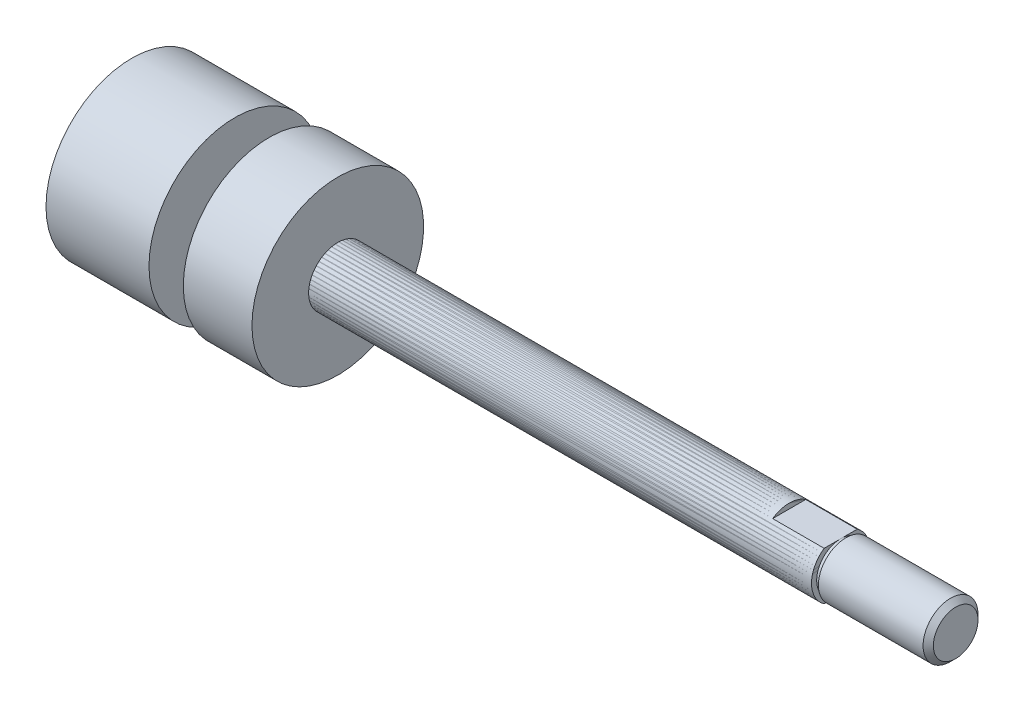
ISO-10303-21;
HEADER;
FILE_DESCRIPTION(('STEP AP214'),'2;1');
FILE_NAME('part.step','',(''),(''),'','','');
FILE_SCHEMA(('AUTOMOTIVE_DESIGN { 1 0 10303 214 1 1 1 1 }'));
ENDSEC;
DATA;
#1=APPLICATION_CONTEXT('core data for automotive mechanical design processes');
#2=APPLICATION_PROTOCOL_DEFINITION('international standard','automotive_design',2000,#1);
#3=PRODUCT_CONTEXT('',#1,'mechanical');
#4=PRODUCT('Part','Part','',(#3));
#5=PRODUCT_RELATED_PRODUCT_CATEGORY('part','',(#4));
#6=PRODUCT_DEFINITION_FORMATION('','',#4);
#7=PRODUCT_DEFINITION_CONTEXT('part definition',#1,'design');
#8=PRODUCT_DEFINITION('design','',#6,#7);
#9=PRODUCT_DEFINITION_SHAPE('','',#8);
#10=(LENGTH_UNIT() NAMED_UNIT(*) SI_UNIT(.MILLI.,.METRE.));
#11=(NAMED_UNIT(*) PLANE_ANGLE_UNIT() SI_UNIT($,.RADIAN.));
#12=(NAMED_UNIT(*) SI_UNIT($,.STERADIAN.) SOLID_ANGLE_UNIT());
#13=UNCERTAINTY_MEASURE_WITH_UNIT(LENGTH_MEASURE(1.E-05),#10,'distance_accuracy_value','');
#14=(GEOMETRIC_REPRESENTATION_CONTEXT(3) GLOBAL_UNCERTAINTY_ASSIGNED_CONTEXT((#13)) GLOBAL_UNIT_ASSIGNED_CONTEXT((#10,
#11,#12)) REPRESENTATION_CONTEXT('',''));
#15=CARTESIAN_POINT('',(0.,0.,0.));
#16=DIRECTION('',(0.,0.,1.));
#17=DIRECTION('',(1.,0.,0.));
#18=AXIS2_PLACEMENT_3D('',#15,#16,#17);
#19=CARTESIAN_POINT('',(119.21874581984,-1.4380063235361,-9.0792146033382));
#20=DIRECTION('',(1.,0.,0.));
#21=DIRECTION('',(0.,0.809016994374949,0.587785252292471));
#22=AXIS2_PLACEMENT_3D('',#19,#20,#21);
#23=PLANE('',#22);
#24=CARTESIAN_POINT('',(119.21874581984,0.,0.));
#25=DIRECTION('',(-1.,0.,0.));
#26=DIRECTION('',(0.,0.,1.));
#27=AXIS2_PLACEMENT_3D('',#24,#25,#26);
#28=CIRCLE('',#27,6.50000000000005);
#29=CARTESIAN_POINT('',(119.21874581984,0.,6.50000000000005));
#30=VERTEX_POINT('',#29);
#31=EDGE_CURVE('P0_E352',#30,#30,#28,.F.);
#32=ORIENTED_EDGE('',*,*,#31,.T.);
#33=EDGE_LOOP('',(#32));
#34=FACE_BOUND('',#33,.T.);
#35=ADVANCED_FACE('P0_F348',(#34),#23,.T.);
#36=CARTESIAN_POINT('',(119.21874581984,0.,0.));
#37=DIRECTION('',(-1.,0.,0.));
#38=DIRECTION('',(0.,0.,1.));
#39=AXIS2_PLACEMENT_3D('',#36,#37,#38);
#40=CONICAL_SURFACE('',#39,6.50000000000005,0.785398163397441);
#41=ORIENTED_EDGE('',*,*,#31,.F.);
#42=EDGE_LOOP('',(#41));
#43=FACE_BOUND('',#42,.T.);
#44=CARTESIAN_POINT('',(117.71874581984,0.,0.));
#45=DIRECTION('',(-1.,0.,0.));
#46=DIRECTION('',(0.,0.809016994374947,0.587785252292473));
#47=AXIS2_PLACEMENT_3D('',#44,#45,#46);
#48=CIRCLE('',#47,8.00000000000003);
#49=CARTESIAN_POINT('',(117.71874581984,6.4721359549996,4.7022820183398));
#50=VERTEX_POINT('',#49);
#51=EDGE_CURVE('P0_E443',#50,#50,#48,.F.);
#52=ORIENTED_EDGE('',*,*,#51,.T.);
#53=EDGE_LOOP('',(#52));
#54=FACE_BOUND('',#53,.T.);
#55=ADVANCED_FACE('P0_F493',(#43,#54),#40,.T.);
#56=CARTESIAN_POINT('',(117.71874581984,0.,0.));
#57=DIRECTION('',(-1.,0.,0.));
#58=DIRECTION('',(0.,0.,1.));
#59=AXIS2_PLACEMENT_3D('',#56,#57,#58);
#60=CYLINDRICAL_SURFACE('',#59,8.00000000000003);
#61=ORIENTED_EDGE('',*,*,#51,.F.);
#62=EDGE_LOOP('',(#61));
#63=FACE_BOUND('',#62,.T.);
#64=CARTESIAN_POINT('',(87.218745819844,0.,0.));
#65=DIRECTION('',(-1.,0.,0.));
#66=DIRECTION('',(0.,0.,1.));
#67=AXIS2_PLACEMENT_3D('',#64,#65,#66);
#68=CIRCLE('',#67,8.00000000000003);
#69=CARTESIAN_POINT('',(87.218745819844,0.,8.00000000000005));
#70=VERTEX_POINT('',#69);
#71=EDGE_CURVE('P0_E441',#70,#70,#68,.T.);
#72=ORIENTED_EDGE('',*,*,#71,.F.);
#73=EDGE_LOOP('',(#72));
#74=FACE_BOUND('',#73,.T.);
#75=ADVANCED_FACE('P0_F497',(#63,#74),#60,.T.);
#76=CARTESIAN_POINT('',(87.218745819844,-11.174417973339,1.7698539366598));
#77=DIRECTION('',(-1.,0.,0.));
#78=DIRECTION('',(0.,0.809016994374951,0.587785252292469));
#79=AXIS2_PLACEMENT_3D('',#76,#77,#78);
#80=PLANE('',#79);
#81=CARTESIAN_POINT('',(87.218745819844,0.,0.));
#82=DIRECTION('',(-1.,0.,0.));
#83=DIRECTION('',(0.,0.,1.));
#84=AXIS2_PLACEMENT_3D('',#81,#82,#83);
#85=CIRCLE('',#84,7.00000000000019);
#86=CARTESIAN_POINT('',(87.218745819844,0.,7.00000000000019));
#87=VERTEX_POINT('',#86);
#88=EDGE_CURVE('P0_E405',#87,#87,#85,.F.);
#89=ORIENTED_EDGE('',*,*,#88,.T.);
#90=EDGE_LOOP('',(#89));
#91=FACE_BOUND('',#90,.T.);
#92=ORIENTED_EDGE('',*,*,#71,.T.);
#93=EDGE_LOOP('',(#92));
#94=FACE_BOUND('',#93,.T.);
#95=ADVANCED_FACE('P0_F495',(#91,#94),#80,.T.);
#96=CARTESIAN_POINT('',(87.218745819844,0.,0.));
#97=DIRECTION('',(-1.,0.,0.));
#98=DIRECTION('',(0.,0.,1.));
#99=AXIS2_PLACEMENT_3D('',#96,#97,#98);
#100=CYLINDRICAL_SURFACE('',#99,7.00000000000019);
#101=ORIENTED_EDGE('',*,*,#88,.F.);
#102=EDGE_LOOP('',(#101));
#103=FACE_BOUND('',#102,.T.);
#104=CARTESIAN_POINT('',(85.718745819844,0.,0.));
#105=DIRECTION('',(-1.,0.,0.));
#106=DIRECTION('',(0.,0.,1.));
#107=AXIS2_PLACEMENT_3D('',#104,#105,#106);
#108=CIRCLE('',#107,7.00000000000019);
#109=CARTESIAN_POINT('',(85.718745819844,7.00000000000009,0.));
#110=VERTEX_POINT('',#109);
#111=CARTESIAN_POINT('',(85.718745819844,-7.00000000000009,1.33543146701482E-13));
#112=VERTEX_POINT('',#111);
#113=EDGE_CURVE('P0_E408',#110,#112,#108,.T.);
#114=ORIENTED_EDGE('',*,*,#113,.F.);
#115=CARTESIAN_POINT('',(85.718745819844,0.,0.));
#116=DIRECTION('',(-1.,0.,0.));
#117=DIRECTION('',(0.,0.,1.));
#118=AXIS2_PLACEMENT_3D('',#115,#116,#117);
#119=CIRCLE('',#118,7.00000000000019);
#120=EDGE_CURVE('P0_E396',#110,#112,#119,.F.);
#121=ORIENTED_EDGE('',*,*,#120,.T.);
#122=EDGE_LOOP('',(#114,#121));
#123=FACE_BOUND('',#122,.T.);
#124=ADVANCED_FACE('P0_F410',(#103,#123),#100,.T.);
#125=CARTESIAN_POINT('',(85.718745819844,-1.880469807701,-11.872819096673));
#126=DIRECTION('',(1.,0.,0.));
#127=DIRECTION('',(0.,0.809016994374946,0.587785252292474));
#128=AXIS2_PLACEMENT_3D('',#125,#126,#127);
#129=PLANE('',#128);
#130=ORIENTED_EDGE('',*,*,#120,.F.);
#131=DIRECTION('',(0.,0.,1.));
#132=VECTOR('',#131,1.);
#133=CARTESIAN_POINT('',(85.718745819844,7.,-2.67817461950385));
#134=LINE('',#133,#132);
#135=CARTESIAN_POINT('',(85.718745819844,7.00000000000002,4.82182538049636));
#136=VERTEX_POINT('',#135);
#137=EDGE_CURVE('P0_E400',#110,#136,#134,.T.);
#138=ORIENTED_EDGE('',*,*,#137,.T.);
#139=CARTESIAN_POINT('',(85.718745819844,0.,0.));
#140=DIRECTION('',(-1.,0.,0.));
#141=DIRECTION('',(0.,0.,1.));
#142=AXIS2_PLACEMENT_3D('',#139,#140,#141);
#143=CIRCLE('',#142,8.49999999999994);
#144=CARTESIAN_POINT('',(85.718745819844,-7.00000000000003,4.82182538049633));
#145=VERTEX_POINT('',#144);
#146=EDGE_CURVE('P0_E365',#136,#145,#143,.F.);
#147=ORIENTED_EDGE('',*,*,#146,.T.);
#148=DIRECTION('',(0.,0.,-1.));
#149=VECTOR('',#148,1.);
#150=CARTESIAN_POINT('',(85.718745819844,-7.,-2.67817461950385));
#151=LINE('',#150,#149);
#152=EDGE_CURVE('P0_E402',#145,#112,#151,.T.);
#153=ORIENTED_EDGE('',*,*,#152,.T.);
#154=EDGE_LOOP('',(#130,#138,#147,#153));
#155=FACE_BOUND('',#154,.T.);
#156=ADVANCED_FACE('P0_F398',(#155),#129,.T.);
#157=CARTESIAN_POINT('',(70.718745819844,-7.,4.8218253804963));
#158=DIRECTION('',(-1.,0.,0.));
#159=DIRECTION('',(0.,0.,-1.));
#160=AXIS2_PLACEMENT_3D('',#157,#158,#159);
#161=PLANE('',#160);
#162=CARTESIAN_POINT('',(70.7187458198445,0.,0.));
#163=DIRECTION('',(-1.,0.,0.));
#164=DIRECTION('',(0.,0.,1.));
#165=AXIS2_PLACEMENT_3D('',#162,#163,#164);
#166=CIRCLE('',#165,8.49999999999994);
#167=CARTESIAN_POINT('',(70.7187458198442,-7.00000000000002,4.82182538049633));
#168=VERTEX_POINT('',#167);
#169=CARTESIAN_POINT('',(70.7187458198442,-7.,-4.82182538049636));
#170=VERTEX_POINT('',#169);
#171=EDGE_CURVE('P0_E435',#168,#170,#166,.F.);
#172=ORIENTED_EDGE('',*,*,#171,.T.);
#173=DIRECTION('',(0.,0.,1.));
#174=VECTOR('',#173,1.);
#175=CARTESIAN_POINT('',(70.718745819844,-7.,-2.67817461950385));
#176=LINE('',#175,#174);
#177=EDGE_CURVE('P0_E414',#170,#168,#176,.T.);
#178=ORIENTED_EDGE('',*,*,#177,.T.);
#179=EDGE_LOOP('',(#172,#178));
#180=FACE_BOUND('',#179,.T.);
#181=ADVANCED_FACE('P0_F466',(#180),#161,.F.);
#182=CARTESIAN_POINT('',(85.718745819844,-7.,4.8218253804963));
#183=DIRECTION('',(0.,1.,0.));
#184=DIRECTION('',(0.,0.,-1.));
#185=AXIS2_PLACEMENT_3D('',#182,#183,#184);
#186=PLANE('',#185);
#187=DIRECTION('',(1.,0.,0.));
#188=VECTOR('',#187,1.);
#189=CARTESIAN_POINT('',(12.468745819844,-6.99999999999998,-4.82182538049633));
#190=LINE('',#189,#188);
#191=CARTESIAN_POINT('',(85.718745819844,-7.00000000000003,-4.82182538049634));
#192=VERTEX_POINT('',#191);
#193=EDGE_CURVE('P0_E434',#170,#192,#190,.T.);
#194=ORIENTED_EDGE('',*,*,#193,.T.);
#195=DIRECTION('',(0.,0.,-1.));
#196=VECTOR('',#195,1.);
#197=CARTESIAN_POINT('',(85.718745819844,-7.00000000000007,0.));
#198=LINE('',#197,#196);
#199=EDGE_CURVE('P0_E413',#112,#192,#198,.T.);
#200=ORIENTED_EDGE('',*,*,#199,.F.);
#201=ORIENTED_EDGE('',*,*,#152,.F.);
#202=DIRECTION('',(-1.,0.,0.));
#203=VECTOR('',#202,1.);
#204=CARTESIAN_POINT('',(12.468745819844,-7.00000000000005,4.82182538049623));
#205=LINE('',#204,#203);
#206=EDGE_CURVE('P0_E437',#145,#168,#205,.T.);
#207=ORIENTED_EDGE('',*,*,#206,.T.);
#208=ORIENTED_EDGE('',*,*,#177,.F.);
#209=EDGE_LOOP('',(#194,#200,#201,#207,#208));
#210=FACE_BOUND('',#209,.T.);
#211=ADVANCED_FACE('P0_F461',(#210),#186,.F.);
#212=CARTESIAN_POINT('',(85.718745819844,-0.784964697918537,-15.5542622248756));
#213=DIRECTION('',(1.,0.,0.));
#214=DIRECTION('',(0.,0.809016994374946,0.587785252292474));
#215=AXIS2_PLACEMENT_3D('',#212,#213,#214);
#216=PLANE('',#215);
#217=CARTESIAN_POINT('',(85.718745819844,0.,0.));
#218=DIRECTION('',(-1.,0.,0.));
#219=DIRECTION('',(0.,0.,1.));
#220=AXIS2_PLACEMENT_3D('',#217,#218,#219);
#221=CIRCLE('',#220,8.49999999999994);
#222=CARTESIAN_POINT('',(85.718745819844,7.00000000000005,-4.82182538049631));
#223=VERTEX_POINT('',#222);
#224=EDGE_CURVE('P0_E420',#192,#223,#221,.F.);
#225=ORIENTED_EDGE('',*,*,#224,.T.);
#226=DIRECTION('',(0.,0.,1.));
#227=VECTOR('',#226,1.);
#228=CARTESIAN_POINT('',(85.718745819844,7.,-2.67817461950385));
#229=LINE('',#228,#227);
#230=EDGE_CURVE('P0_E417',#223,#110,#229,.T.);
#231=ORIENTED_EDGE('',*,*,#230,.T.);
#232=ORIENTED_EDGE('',*,*,#113,.T.);
#233=ORIENTED_EDGE('',*,*,#199,.T.);
#234=EDGE_LOOP('',(#225,#231,#232,#233));
#235=FACE_BOUND('',#234,.T.);
#236=ADVANCED_FACE('P0_F418',(#235),#216,.T.);
#237=CARTESIAN_POINT('',(70.718745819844,10.3214285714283,4.8218253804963));
#238=DIRECTION('',(-1.,0.,0.));
#239=DIRECTION('',(0.,0.,-1.));
#240=AXIS2_PLACEMENT_3D('',#237,#238,#239);
#241=PLANE('',#240);
#242=CARTESIAN_POINT('',(70.7187458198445,0.,0.));
#243=DIRECTION('',(-1.,0.,0.));
#244=DIRECTION('',(0.,0.,1.));
#245=AXIS2_PLACEMENT_3D('',#242,#243,#244);
#246=CIRCLE('',#245,8.49999999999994);
#247=CARTESIAN_POINT('',(70.7187458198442,7.00000000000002,-4.8218253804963));
#248=VERTEX_POINT('',#247);
#249=CARTESIAN_POINT('',(70.7187458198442,7.,4.82182538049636));
#250=VERTEX_POINT('',#249);
#251=EDGE_CURVE('P0_E357',#248,#250,#246,.F.);
#252=ORIENTED_EDGE('',*,*,#251,.T.);
#253=DIRECTION('',(0.,0.,-1.));
#254=VECTOR('',#253,1.);
#255=CARTESIAN_POINT('',(70.718745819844,7.,-2.67817461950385));
#256=LINE('',#255,#254);
#257=EDGE_CURVE('P0_E425',#250,#248,#256,.T.);
#258=ORIENTED_EDGE('',*,*,#257,.T.);
#259=EDGE_LOOP('',(#252,#258));
#260=FACE_BOUND('',#259,.T.);
#261=ADVANCED_FACE('P0_F487',(#260),#241,.F.);
#262=CARTESIAN_POINT('',(70.718745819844,7.,4.8218253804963));
#263=DIRECTION('',(0.,-1.,0.));
#264=DIRECTION('',(0.,0.,-1.));
#265=AXIS2_PLACEMENT_3D('',#262,#263,#264);
#266=PLANE('',#265);
#267=DIRECTION('',(1.,0.,0.));
#268=VECTOR('',#267,1.);
#269=CARTESIAN_POINT('',(12.468745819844,6.99999999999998,4.82182538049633));
#270=LINE('',#269,#268);
#271=EDGE_CURVE('P0_E11',#250,#136,#270,.T.);
#272=ORIENTED_EDGE('',*,*,#271,.T.);
#273=ORIENTED_EDGE('',*,*,#137,.F.);
#274=ORIENTED_EDGE('',*,*,#230,.F.);
#275=DIRECTION('',(-1.,0.,0.));
#276=VECTOR('',#275,1.);
#277=CARTESIAN_POINT('',(12.468745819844,7.00000000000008,-4.82182538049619));
#278=LINE('',#277,#276);
#279=EDGE_CURVE('P0_E432',#223,#248,#278,.T.);
#280=ORIENTED_EDGE('',*,*,#279,.T.);
#281=ORIENTED_EDGE('',*,*,#257,.F.);
#282=EDGE_LOOP('',(#272,#273,#274,#280,#281));
#283=FACE_BOUND('',#282,.T.);
#284=ADVANCED_FACE('P0_F350',(#283),#266,.F.);
#285=CARTESIAN_POINT('',(85.718745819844,0.,0.));
#286=DIRECTION('',(-1.,0.,0.));
#287=DIRECTION('',(0.,0.,1.));
#288=AXIS2_PLACEMENT_3D('',#285,#286,#287);
#289=CYLINDRICAL_SURFACE('',#288,8.49999999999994);
#290=ORIENTED_EDGE('',*,*,#146,.F.);
#291=ORIENTED_EDGE('',*,*,#271,.F.);
#292=ORIENTED_EDGE('',*,*,#251,.F.);
#293=ORIENTED_EDGE('',*,*,#279,.F.);
#294=ORIENTED_EDGE('',*,*,#224,.F.);
#295=ORIENTED_EDGE('',*,*,#193,.F.);
#296=ORIENTED_EDGE('',*,*,#171,.F.);
#297=ORIENTED_EDGE('',*,*,#206,.F.);
#298=EDGE_LOOP('',(#290,#291,#292,#293,#294,#295,#296,#297));
#299=FACE_BOUND('',#298,.T.);
#300=CARTESIAN_POINT('',(-90.781254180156,0.,0.));
#301=DIRECTION('',(-1.,0.,0.));
#302=DIRECTION('',(0.,0.,1.));
#303=AXIS2_PLACEMENT_3D('',#300,#301,#302);
#304=CIRCLE('',#303,8.49999999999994);
#305=CARTESIAN_POINT('',(-90.781254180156,0.,8.49999999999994));
#306=VERTEX_POINT('',#305);
#307=EDGE_CURVE('P0_E451',#306,#306,#304,.T.);
#308=ORIENTED_EDGE('',*,*,#307,.F.);
#309=EDGE_LOOP('',(#308));
#310=FACE_BOUND('',#309,.T.);
#311=ADVANCED_FACE('P0_F463',(#299,#310),#289,.T.);
#312=CARTESIAN_POINT('',(-90.781254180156,0.,0.));
#313=DIRECTION('',(-1.,0.,0.));
#314=DIRECTION('',(0.,0.,1.));
#315=AXIS2_PLACEMENT_3D('',#312,#313,#314);
#316=PLANE('',#315);
#317=CARTESIAN_POINT('',(-90.781254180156,0.,0.));
#318=DIRECTION('',(-1.,0.,0.));
#319=DIRECTION('',(0.,0.,1.));
#320=AXIS2_PLACEMENT_3D('',#317,#318,#319);
#321=CIRCLE('',#320,25.);
#322=CARTESIAN_POINT('',(-90.781254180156,0.,25.));
#323=VERTEX_POINT('',#322);
#324=EDGE_CURVE('P0_E527',#323,#323,#321,.T.);
#325=ORIENTED_EDGE('',*,*,#324,.F.);
#326=EDGE_LOOP('',(#325));
#327=FACE_BOUND('',#326,.T.);
#328=ORIENTED_EDGE('',*,*,#307,.T.);
#329=EDGE_LOOP('',(#328));
#330=FACE_BOUND('',#329,.T.);
#331=ADVANCED_FACE('P0_F477',(#327,#330),#316,.F.);
#332=CARTESIAN_POINT('',(-120.781254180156,0.,0.));
#333=DIRECTION('',(1.,0.,0.));
#334=DIRECTION('',(0.,0.,-1.));
#335=AXIS2_PLACEMENT_3D('',#332,#333,#334);
#336=CYLINDRICAL_SURFACE('',#335,25.);
#337=CARTESIAN_POINT('',(-120.781254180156,0.,0.));
#338=DIRECTION('',(-1.,0.,0.));
#339=DIRECTION('',(0.,0.,1.));
#340=AXIS2_PLACEMENT_3D('',#337,#338,#339);
#341=CIRCLE('',#340,25.);
#342=CARTESIAN_POINT('',(-120.781254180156,0.,25.));
#343=VERTEX_POINT('',#342);
#344=EDGE_CURVE('P0_E525',#343,#343,#341,.T.);
#345=ORIENTED_EDGE('',*,*,#344,.F.);
#346=EDGE_LOOP('',(#345));
#347=FACE_BOUND('',#346,.T.);
#348=ORIENTED_EDGE('',*,*,#324,.T.);
#349=EDGE_LOOP('',(#348));
#350=FACE_BOUND('',#349,.T.);
#351=ADVANCED_FACE('P0_F483',(#347,#350),#336,.T.);
#352=CARTESIAN_POINT('',(-120.781254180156,0.,0.));
#353=DIRECTION('',(-1.,0.,0.));
#354=DIRECTION('',(0.,0.,1.));
#355=AXIS2_PLACEMENT_3D('',#352,#353,#354);
#356=PLANE('',#355);
#357=ORIENTED_EDGE('',*,*,#344,.T.);
#358=EDGE_LOOP('',(#357));
#359=FACE_BOUND('',#358,.T.);
#360=ADVANCED_FACE('P0_F517',(#359),#356,.T.);
#361=CLOSED_SHELL('',(#35,#55,#75,#95,#124,#156,#181,#211,#236,#261,#284,#311,#331,#351,#360));
#362=MANIFOLD_SOLID_BREP('P0_B2',#361);
#363=CARTESIAN_POINT('',(119.21874581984,-1.4380063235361,-9.0792146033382));
#364=DIRECTION('',(1.,0.,0.));
#365=DIRECTION('',(0.,0.809016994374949,0.587785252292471));
#366=AXIS2_PLACEMENT_3D('',#363,#364,#365);
#367=PLANE('',#366);
#368=CARTESIAN_POINT('',(119.21874581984,0.,0.));
#369=DIRECTION('',(-1.,0.,0.));
#370=DIRECTION('',(0.,0.,1.));
#371=AXIS2_PLACEMENT_3D('',#368,#369,#370);
#372=CIRCLE('',#371,6.50000000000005);
#373=CARTESIAN_POINT('',(119.21874581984,0.,6.50000000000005));
#374=VERTEX_POINT('',#373);
#375=EDGE_CURVE('P1_E19',#374,#374,#372,.F.);
#376=ORIENTED_EDGE('',*,*,#375,.T.);
#377=EDGE_LOOP('',(#376));
#378=FACE_BOUND('',#377,.T.);
#379=ADVANCED_FACE('P1_F15',(#378),#367,.T.);
#380=CARTESIAN_POINT('',(119.21874581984,0.,0.));
#381=DIRECTION('',(-1.,0.,0.));
#382=DIRECTION('',(0.,0.,1.));
#383=AXIS2_PLACEMENT_3D('',#380,#381,#382);
#384=CONICAL_SURFACE('',#383,6.50000000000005,0.785398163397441);
#385=ORIENTED_EDGE('',*,*,#375,.F.);
#386=EDGE_LOOP('',(#385));
#387=FACE_BOUND('',#386,.T.);
#388=CARTESIAN_POINT('',(117.71874581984,0.,0.));
#389=DIRECTION('',(-1.,0.,0.));
#390=DIRECTION('',(0.,0.809016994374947,0.587785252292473));
#391=AXIS2_PLACEMENT_3D('',#388,#389,#390);
#392=CIRCLE('',#391,8.00000000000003);
#393=CARTESIAN_POINT('',(117.71874581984,6.4721359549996,4.7022820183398));
#394=VERTEX_POINT('',#393);
#395=EDGE_CURVE('P1_E119',#394,#394,#392,.F.);
#396=ORIENTED_EDGE('',*,*,#395,.T.);
#397=EDGE_LOOP('',(#396));
#398=FACE_BOUND('',#397,.T.);
#399=ADVANCED_FACE('P1_F168',(#387,#398),#384,.T.);
#400=CARTESIAN_POINT('',(117.71874581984,0.,0.));
#401=DIRECTION('',(-1.,0.,0.));
#402=DIRECTION('',(0.,0.,1.));
#403=AXIS2_PLACEMENT_3D('',#400,#401,#402);
#404=CYLINDRICAL_SURFACE('',#403,8.00000000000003);
#405=ORIENTED_EDGE('',*,*,#395,.F.);
#406=EDGE_LOOP('',(#405));
#407=FACE_BOUND('',#406,.T.);
#408=CARTESIAN_POINT('',(87.218745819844,0.,0.));
#409=DIRECTION('',(-1.,0.,0.));
#410=DIRECTION('',(0.,0.,1.));
#411=AXIS2_PLACEMENT_3D('',#408,#409,#410);
#412=CIRCLE('',#411,8.00000000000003);
#413=CARTESIAN_POINT('',(87.218745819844,0.,8.00000000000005));
#414=VERTEX_POINT('',#413);
#415=EDGE_CURVE('P1_E117',#414,#414,#412,.T.);
#416=ORIENTED_EDGE('',*,*,#415,.F.);
#417=EDGE_LOOP('',(#416));
#418=FACE_BOUND('',#417,.T.);
#419=ADVANCED_FACE('P1_F172',(#407,#418),#404,.T.);
#420=CARTESIAN_POINT('',(87.218745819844,-11.174417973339,1.7698539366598));
#421=DIRECTION('',(-1.,0.,0.));
#422=DIRECTION('',(0.,0.809016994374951,0.587785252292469));
#423=AXIS2_PLACEMENT_3D('',#420,#421,#422);
#424=PLANE('',#423);
#425=CARTESIAN_POINT('',(87.218745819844,0.,0.));
#426=DIRECTION('',(-1.,0.,0.));
#427=DIRECTION('',(0.,0.,1.));
#428=AXIS2_PLACEMENT_3D('',#425,#426,#427);
#429=CIRCLE('',#428,7.00000000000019);
#430=CARTESIAN_POINT('',(87.218745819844,0.,7.00000000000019));
#431=VERTEX_POINT('',#430);
#432=EDGE_CURVE('P1_E74',#431,#431,#429,.F.);
#433=ORIENTED_EDGE('',*,*,#432,.T.);
#434=EDGE_LOOP('',(#433));
#435=FACE_BOUND('',#434,.T.);
#436=ORIENTED_EDGE('',*,*,#415,.T.);
#437=EDGE_LOOP('',(#436));
#438=FACE_BOUND('',#437,.T.);
#439=ADVANCED_FACE('P1_F170',(#435,#438),#424,.T.);
#440=CARTESIAN_POINT('',(87.218745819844,0.,0.));
#441=DIRECTION('',(-1.,0.,0.));
#442=DIRECTION('',(0.,0.,1.));
#443=AXIS2_PLACEMENT_3D('',#440,#441,#442);
#444=CYLINDRICAL_SURFACE('',#443,7.00000000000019);
#445=ORIENTED_EDGE('',*,*,#432,.F.);
#446=EDGE_LOOP('',(#445));
#447=FACE_BOUND('',#446,.T.);
#448=CARTESIAN_POINT('',(85.718745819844,0.,0.));
#449=DIRECTION('',(-1.,0.,0.));
#450=DIRECTION('',(0.,0.,1.));
#451=AXIS2_PLACEMENT_3D('',#448,#449,#450);
#452=CIRCLE('',#451,7.00000000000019);
#453=CARTESIAN_POINT('',(85.718745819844,7.00000000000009,0.));
#454=VERTEX_POINT('',#453);
#455=CARTESIAN_POINT('',(85.718745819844,-7.00000000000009,1.33543146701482E-13));
#456=VERTEX_POINT('',#455);
#457=EDGE_CURVE('P1_E77',#454,#456,#452,.T.);
#458=ORIENTED_EDGE('',*,*,#457,.F.);
#459=CARTESIAN_POINT('',(85.718745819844,0.,0.));
#460=DIRECTION('',(-1.,0.,0.));
#461=DIRECTION('',(0.,0.,1.));
#462=AXIS2_PLACEMENT_3D('',#459,#460,#461);
#463=CIRCLE('',#462,7.00000000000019);
#464=EDGE_CURVE('P1_E64',#454,#456,#463,.F.);
#465=ORIENTED_EDGE('',*,*,#464,.T.);
#466=EDGE_LOOP('',(#458,#465));
#467=FACE_BOUND('',#466,.T.);
#468=ADVANCED_FACE('P1_F79',(#447,#467),#444,.T.);
#469=CARTESIAN_POINT('',(85.718745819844,-1.880469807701,-11.872819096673));
#470=DIRECTION('',(1.,0.,0.));
#471=DIRECTION('',(0.,0.809016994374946,0.587785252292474));
#472=AXIS2_PLACEMENT_3D('',#469,#470,#471);
#473=PLANE('',#472);
#474=ORIENTED_EDGE('',*,*,#464,.F.);
#475=DIRECTION('',(0.,0.,1.));
#476=VECTOR('',#475,1.);
#477=CARTESIAN_POINT('',(85.718745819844,7.,-2.67817461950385));
#478=LINE('',#477,#476);
#479=CARTESIAN_POINT('',(85.718745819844,7.00000000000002,4.82182538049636));
#480=VERTEX_POINT('',#479);
#481=EDGE_CURVE('P1_E68',#454,#480,#478,.T.);
#482=ORIENTED_EDGE('',*,*,#481,.T.);
#483=CARTESIAN_POINT('',(85.718745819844,0.,0.));
#484=DIRECTION('',(-1.,0.,0.));
#485=DIRECTION('',(0.,0.,1.));
#486=AXIS2_PLACEMENT_3D('',#483,#484,#485);
#487=CIRCLE('',#486,8.49999999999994);
#488=CARTESIAN_POINT('',(85.718745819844,-7.00000000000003,4.82182538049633));
#489=VERTEX_POINT('',#488);
#490=EDGE_CURVE('P1_E32',#480,#489,#487,.F.);
#491=ORIENTED_EDGE('',*,*,#490,.T.);
#492=DIRECTION('',(0.,0.,-1.));
#493=VECTOR('',#492,1.);
#494=CARTESIAN_POINT('',(85.718745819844,-7.,-2.67817461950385));
#495=LINE('',#494,#493);
#496=EDGE_CURVE('P1_E71',#489,#456,#495,.T.);
#497=ORIENTED_EDGE('',*,*,#496,.T.);
#498=EDGE_LOOP('',(#474,#482,#491,#497));
#499=FACE_BOUND('',#498,.T.);
#500=ADVANCED_FACE('P1_F66',(#499),#473,.T.);
#501=CARTESIAN_POINT('',(70.718745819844,-7.,4.8218253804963));
#502=DIRECTION('',(-1.,0.,0.));
#503=DIRECTION('',(0.,0.,-1.));
#504=AXIS2_PLACEMENT_3D('',#501,#502,#503);
#505=PLANE('',#504);
#506=CARTESIAN_POINT('',(70.7187458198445,0.,0.));
#507=DIRECTION('',(-1.,0.,0.));
#508=DIRECTION('',(0.,0.,1.));
#509=AXIS2_PLACEMENT_3D('',#506,#507,#508);
#510=CIRCLE('',#509,8.49999999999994);
#511=CARTESIAN_POINT('',(70.7187458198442,-7.00000000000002,4.82182538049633));
#512=VERTEX_POINT('',#511);
#513=CARTESIAN_POINT('',(70.7187458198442,-7.,-4.82182538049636));
#514=VERTEX_POINT('',#513);
#515=EDGE_CURVE('P1_E111',#512,#514,#510,.F.);
#516=ORIENTED_EDGE('',*,*,#515,.T.);
#517=DIRECTION('',(0.,0.,1.));
#518=VECTOR('',#517,1.);
#519=CARTESIAN_POINT('',(70.718745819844,-7.,-2.67817461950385));
#520=LINE('',#519,#518);
#521=EDGE_CURVE('P1_E83',#514,#512,#520,.T.);
#522=ORIENTED_EDGE('',*,*,#521,.T.);
#523=EDGE_LOOP('',(#516,#522));
#524=FACE_BOUND('',#523,.T.);
#525=ADVANCED_FACE('P1_F140',(#524),#505,.F.);
#526=CARTESIAN_POINT('',(85.718745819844,-7.,4.8218253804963));
#527=DIRECTION('',(0.,1.,0.));
#528=DIRECTION('',(0.,0.,-1.));
#529=AXIS2_PLACEMENT_3D('',#526,#527,#528);
#530=PLANE('',#529);
#531=DIRECTION('',(1.,0.,0.));
#532=VECTOR('',#531,1.);
#533=CARTESIAN_POINT('',(12.468745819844,-6.99999999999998,-4.82182538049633));
#534=LINE('',#533,#532);
#535=CARTESIAN_POINT('',(85.718745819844,-7.00000000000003,-4.82182538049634));
#536=VERTEX_POINT('',#535);
#537=EDGE_CURVE('P1_E110',#514,#536,#534,.T.);
#538=ORIENTED_EDGE('',*,*,#537,.T.);
#539=DIRECTION('',(0.,0.,-1.));
#540=VECTOR('',#539,1.);
#541=CARTESIAN_POINT('',(85.718745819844,-7.00000000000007,0.));
#542=LINE('',#541,#540);
#543=EDGE_CURVE('P1_E82',#456,#536,#542,.T.);
#544=ORIENTED_EDGE('',*,*,#543,.F.);
#545=ORIENTED_EDGE('',*,*,#496,.F.);
#546=DIRECTION('',(-1.,0.,0.));
#547=VECTOR('',#546,1.);
#548=CARTESIAN_POINT('',(12.468745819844,-7.00000000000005,4.82182538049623));
#549=LINE('',#548,#547);
#550=EDGE_CURVE('P1_E113',#489,#512,#549,.T.);
#551=ORIENTED_EDGE('',*,*,#550,.T.);
#552=ORIENTED_EDGE('',*,*,#521,.F.);
#553=EDGE_LOOP('',(#538,#544,#545,#551,#552));
#554=FACE_BOUND('',#553,.T.);
#555=ADVANCED_FACE('P1_F135',(#554),#530,.F.);
#556=CARTESIAN_POINT('',(85.718745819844,-0.784964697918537,-15.5542622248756));
#557=DIRECTION('',(1.,0.,0.));
#558=DIRECTION('',(0.,0.809016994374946,0.587785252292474));
#559=AXIS2_PLACEMENT_3D('',#556,#557,#558);
#560=PLANE('',#559);
#561=CARTESIAN_POINT('',(85.718745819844,0.,0.));
#562=DIRECTION('',(-1.,0.,0.));
#563=DIRECTION('',(0.,0.,1.));
#564=AXIS2_PLACEMENT_3D('',#561,#562,#563);
#565=CIRCLE('',#564,8.49999999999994);
#566=CARTESIAN_POINT('',(85.718745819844,7.00000000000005,-4.82182538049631));
#567=VERTEX_POINT('',#566);
#568=EDGE_CURVE('P1_E89',#536,#567,#565,.F.);
#569=ORIENTED_EDGE('',*,*,#568,.T.);
#570=DIRECTION('',(0.,0.,1.));
#571=VECTOR('',#570,1.);
#572=CARTESIAN_POINT('',(85.718745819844,7.,-2.67817461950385));
#573=LINE('',#572,#571);
#574=EDGE_CURVE('P1_E86',#567,#454,#573,.T.);
#575=ORIENTED_EDGE('',*,*,#574,.T.);
#576=ORIENTED_EDGE('',*,*,#457,.T.);
#577=ORIENTED_EDGE('',*,*,#543,.T.);
#578=EDGE_LOOP('',(#569,#575,#576,#577));
#579=FACE_BOUND('',#578,.T.);
#580=ADVANCED_FACE('P1_F87',(#579),#560,.T.);
#581=CARTESIAN_POINT('',(70.718745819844,10.3214285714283,4.8218253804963));
#582=DIRECTION('',(-1.,0.,0.));
#583=DIRECTION('',(0.,0.,-1.));
#584=AXIS2_PLACEMENT_3D('',#581,#582,#583);
#585=PLANE('',#584);
#586=CARTESIAN_POINT('',(70.7187458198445,0.,0.));
#587=DIRECTION('',(-1.,0.,0.));
#588=DIRECTION('',(0.,0.,1.));
#589=AXIS2_PLACEMENT_3D('',#586,#587,#588);
#590=CIRCLE('',#589,8.49999999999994);
#591=CARTESIAN_POINT('',(70.7187458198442,7.00000000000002,-4.8218253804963));
#592=VERTEX_POINT('',#591);
#593=CARTESIAN_POINT('',(70.7187458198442,7.,4.82182538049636));
#594=VERTEX_POINT('',#593);
#595=EDGE_CURVE('P1_E40',#592,#594,#590,.F.);
#596=ORIENTED_EDGE('',*,*,#595,.T.);
#597=DIRECTION('',(0.,0.,-1.));
#598=VECTOR('',#597,1.);
#599=CARTESIAN_POINT('',(70.718745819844,7.,-2.67817461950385));
#600=LINE('',#599,#598);
#601=EDGE_CURVE('P1_E96',#594,#592,#600,.T.);
#602=ORIENTED_EDGE('',*,*,#601,.T.);
#603=EDGE_LOOP('',(#596,#602));
#604=FACE_BOUND('',#603,.T.);
#605=ADVANCED_FACE('P1_F193',(#604),#585,.F.);
#606=CARTESIAN_POINT('',(70.718745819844,7.,4.8218253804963));
#607=DIRECTION('',(0.,-1.,0.));
#608=DIRECTION('',(0.,0.,-1.));
#609=AXIS2_PLACEMENT_3D('',#606,#607,#608);
#610=PLANE('',#609);
#611=DIRECTION('',(1.,0.,0.));
#612=VECTOR('',#611,1.);
#613=CARTESIAN_POINT('',(12.468745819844,6.99999999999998,4.82182538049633));
#614=LINE('',#613,#612);
#615=EDGE_CURVE('P1_E95',#594,#480,#614,.T.);
#616=ORIENTED_EDGE('',*,*,#615,.T.);
#617=ORIENTED_EDGE('',*,*,#481,.F.);
#618=ORIENTED_EDGE('',*,*,#574,.F.);
#619=DIRECTION('',(-1.,0.,0.));
#620=VECTOR('',#619,1.);
#621=CARTESIAN_POINT('',(12.468745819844,7.00000000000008,-4.82182538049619));
#622=LINE('',#621,#620);
#623=EDGE_CURVE('P1_E108',#567,#592,#622,.T.);
#624=ORIENTED_EDGE('',*,*,#623,.T.);
#625=ORIENTED_EDGE('',*,*,#601,.F.);
#626=EDGE_LOOP('',(#616,#617,#618,#624,#625));
#627=FACE_BOUND('',#626,.T.);
#628=ADVANCED_FACE('P1_F94',(#627),#610,.F.);
#629=CARTESIAN_POINT('',(85.718745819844,0.,0.));
#630=DIRECTION('',(-1.,0.,0.));
#631=DIRECTION('',(0.,0.,1.));
#632=AXIS2_PLACEMENT_3D('',#629,#630,#631);
#633=CYLINDRICAL_SURFACE('',#632,8.49999999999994);
#634=ORIENTED_EDGE('',*,*,#490,.F.);
#635=ORIENTED_EDGE('',*,*,#615,.F.);
#636=ORIENTED_EDGE('',*,*,#595,.F.);
#637=ORIENTED_EDGE('',*,*,#623,.F.);
#638=ORIENTED_EDGE('',*,*,#568,.F.);
#639=ORIENTED_EDGE('',*,*,#537,.F.);
#640=ORIENTED_EDGE('',*,*,#515,.F.);
#641=ORIENTED_EDGE('',*,*,#550,.F.);
#642=EDGE_LOOP('',(#634,#635,#636,#637,#638,#639,#640,#641));
#643=FACE_BOUND('',#642,.T.);
#644=CARTESIAN_POINT('',(-60.781254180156,0.,0.));
#645=DIRECTION('',(-1.,0.,0.));
#646=DIRECTION('',(0.,0.,1.));
#647=AXIS2_PLACEMENT_3D('',#644,#645,#646);
#648=CIRCLE('',#647,8.49999999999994);
#649=CARTESIAN_POINT('',(-60.781254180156,0.,8.49999999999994));
#650=VERTEX_POINT('',#649);
#651=EDGE_CURVE('P1_E104',#650,#650,#648,.T.);
#652=ORIENTED_EDGE('',*,*,#651,.F.);
#653=EDGE_LOOP('',(#652));
#654=FACE_BOUND('',#653,.T.);
#655=ADVANCED_FACE('P1_F137',(#643,#654),#633,.T.);
#656=CARTESIAN_POINT('',(-60.781254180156,-5.5307935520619,-34.920056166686));
#657=DIRECTION('',(1.,0.,0.));
#658=DIRECTION('',(0.,0.80901699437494,0.587785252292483));
#659=AXIS2_PLACEMENT_3D('',#656,#657,#658);
#660=PLANE('',#659);
#661=ORIENTED_EDGE('',*,*,#651,.T.);
#662=EDGE_LOOP('',(#661));
#663=FACE_BOUND('',#662,.T.);
#664=CARTESIAN_POINT('',(-60.781254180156,0.,0.));
#665=DIRECTION('',(-1.,0.,0.));
#666=DIRECTION('',(0.,0.,1.));
#667=AXIS2_PLACEMENT_3D('',#664,#665,#666);
#668=CIRCLE('',#667,25.0000000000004);
#669=CARTESIAN_POINT('',(-60.781254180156,0.,25.0000000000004));
#670=VERTEX_POINT('',#669);
#671=EDGE_CURVE('P1_E24',#670,#670,#668,.F.);
#672=ORIENTED_EDGE('',*,*,#671,.T.);
#673=EDGE_LOOP('',(#672));
#674=FACE_BOUND('',#673,.T.);
#675=ADVANCED_FACE('P1_F154',(#663,#674),#660,.T.);
#676=CARTESIAN_POINT('',(-60.781254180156,0.,0.));
#677=DIRECTION('',(-1.,0.,0.));
#678=DIRECTION('',(0.,0.,1.));
#679=AXIS2_PLACEMENT_3D('',#676,#677,#678);
#680=CYLINDRICAL_SURFACE('',#679,25.0000000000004);
#681=ORIENTED_EDGE('',*,*,#671,.F.);
#682=EDGE_LOOP('',(#681));
#683=FACE_BOUND('',#682,.T.);
#684=CARTESIAN_POINT('',(-80.781254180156,0.,0.));
#685=DIRECTION('',(-1.,0.,0.));
#686=DIRECTION('',(0.,0.,1.));
#687=AXIS2_PLACEMENT_3D('',#684,#685,#686);
#688=CIRCLE('',#687,25.0000000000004);
#689=CARTESIAN_POINT('',(-80.781254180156,0.,25.0000000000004));
#690=VERTEX_POINT('',#689);
#691=EDGE_CURVE('P1_E10',#690,#690,#688,.T.);
#692=ORIENTED_EDGE('',*,*,#691,.F.);
#693=EDGE_LOOP('',(#692));
#694=FACE_BOUND('',#693,.T.);
#695=ADVANCED_FACE('P1_F150',(#683,#694),#680,.T.);
#696=CARTESIAN_POINT('',(-80.781254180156,-34.920056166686,5.5307935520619));
#697=DIRECTION('',(-1.,0.,0.));
#698=DIRECTION('',(0.,0.809016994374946,0.587785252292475));
#699=AXIS2_PLACEMENT_3D('',#696,#697,#698);
#700=PLANE('',#699);
#701=ORIENTED_EDGE('',*,*,#691,.T.);
#702=EDGE_LOOP('',(#701));
#703=FACE_BOUND('',#702,.T.);
#704=ADVANCED_FACE('P1_F17',(#703),#700,.T.);
#705=CLOSED_SHELL('',(#379,#399,#419,#439,#468,#500,#525,#555,#580,#605,#628,#655,#675,#695,#704));
#706=MANIFOLD_SOLID_BREP('P1_B1',#705);
#707=ADVANCED_BREP_SHAPE_REPRESENTATION('',(#18,#362,#706),#14);
#708=SHAPE_DEFINITION_REPRESENTATION(#9,#707);
ENDSEC;
END-ISO-10303-21;
